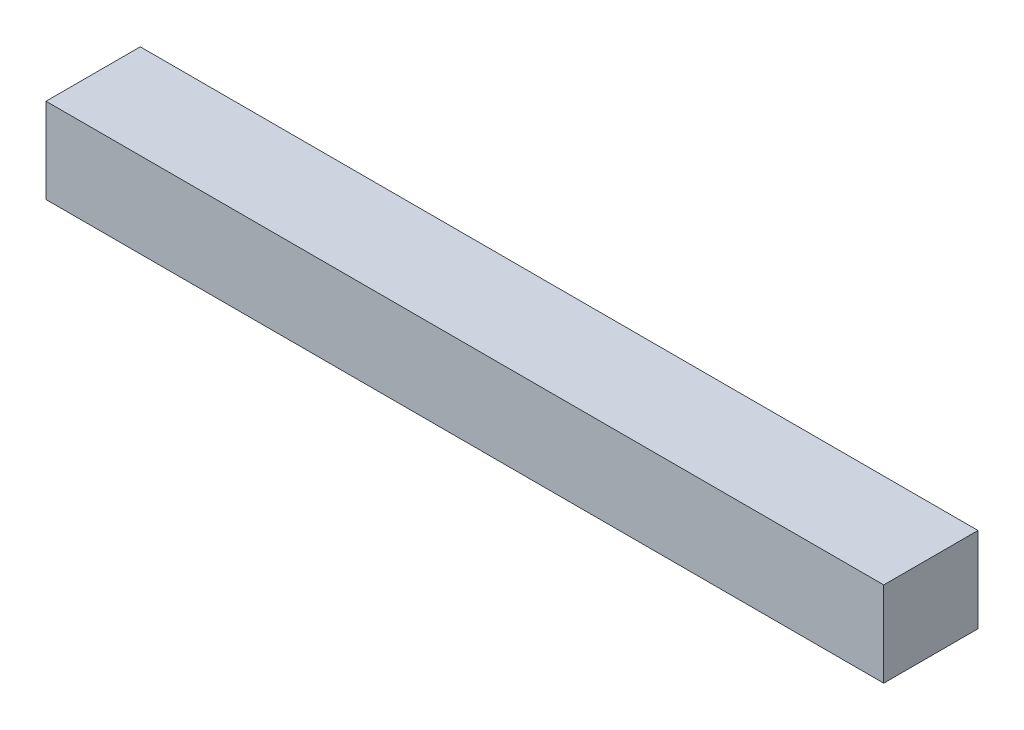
from build123d import *

# Parameters (mm, degrees)
SKETCH_1_W          = 275.5
SKETCH_1_H          = 31
EXTRUDE_1_DEPTH     = 28
CUT_EXTRUDE_START   = 6
SKETCH_1_3_W        = 263.5
SKETCH_1_3_H        = 19
CUT_EXTRUDE_1_DEPTH = 16


with BuildPart() as part:
    # Sketch 1 → Extrude 1 (new body)
    with BuildSketch(Plane(origin=(0, 0, 0), x_dir=(1, 0, 0), z_dir=(0, 1, 0))):
        Rectangle(SKETCH_1_W, SKETCH_1_H)
    extrude(amount=EXTRUDE_1_DEPTH)

    # Sketch 1_3 → Cut-Extrude 1 (cut)
    with BuildSketch(Plane(origin=(0, 0, 0), x_dir=(1, 0, 0), z_dir=(0, 1, 0)).offset(CUT_EXTRUDE_START)):
        Rectangle(SKETCH_1_3_W, SKETCH_1_3_H)
    extrude(amount=CUT_EXTRUDE_1_DEPTH, mode=Mode.SUBTRACT)


solid = part.part
